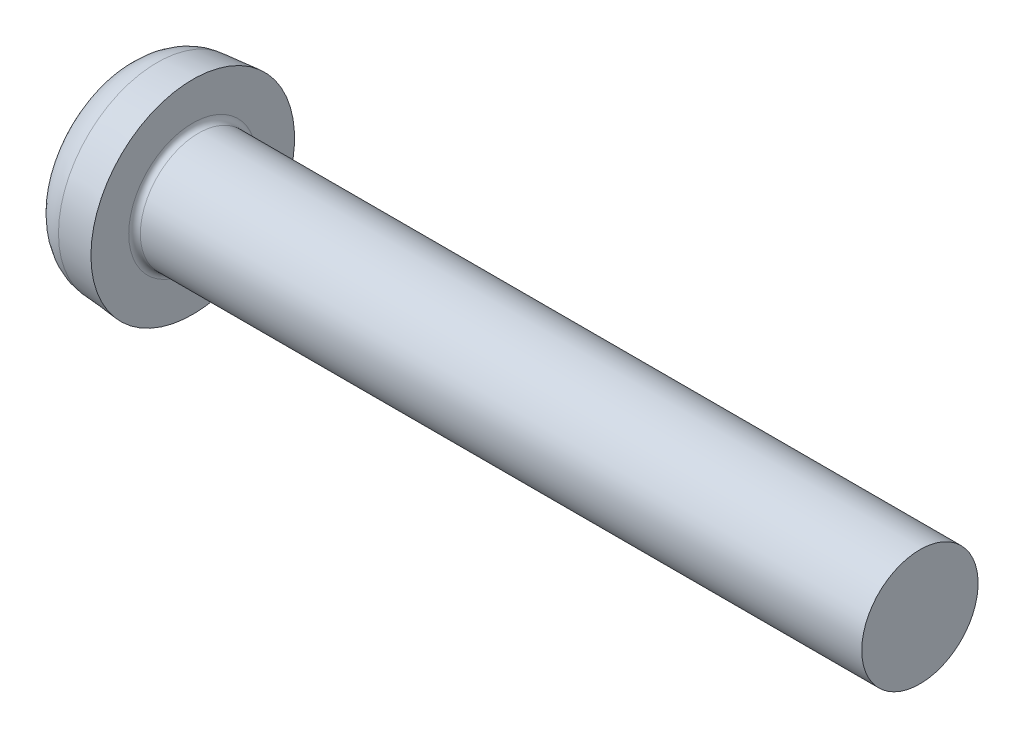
from build123d import *

# Parameters (mm, degrees)
FILLET1_R    = 0.4
RECPAT_COUNT = 2
RECPAT_ANGLE = 90


with BuildPart() as part:
    # BodySke → BaseBody (revolve)
    with BuildSketch(Plane.XY, mode=Mode.PRIVATE) as basebody_sk:
        with BuildLine():
            Line((5.4, 4), (5.4, 7))
            Line((5.4, 7), (2.956076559, 6.786184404))
            ThreePointArc((2.956076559, 6.786184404), (1.52557938, 6.199578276), (0.681056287, 4.904506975))
            ThreePointArc((0.681056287, 4.904506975), (0.171077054, 2.475784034), (0, 0))
            Line((0, 0), (55.4, 0))
            Line((55.4, 0), (55.4, 4))
            Line((55.4, 4), (5.4, 4))
        make_face()
    revolve(basebody_sk.sketch.rotate(Axis((0, 0, 0), (1, 0, 0)), 90), axis=Axis((0, 0, 0), (1, 0, 0)))

    # Fillet1
    fillet1_edges = [part.edges().sort_by_distance(p)[0] for p in [
        (5.4, 0, -4),
    ]]
    fillet(fillet1_edges, radius=FILLET1_R)

    # RecSkeTop → Recess section 0
    with BuildSketch(Plane(origin=(0, 0, 0), x_dir=(0, 0, -1), z_dir=(1, 0, 0))):
        with BuildLine():
            Line((-0.858, 3.9), (0.858, 3.9))
            Line((0.858, 3.9), (0.858, -3.9))
            Line((0.858, -3.9), (-0.858, -3.9))
            Line((-0.858, -3.9), (-0.858, 3.9))
        make_face()
    # RecSkeBot → Recess section 1
    with BuildSketch(Plane(origin=(4.36, 0, 0), x_dir=(0, 0, -1), z_dir=(1, 0, 0))):
        with BuildLine():
            Line((-0.858, 1.726184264), (0.858, 1.726184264))
            Line((0.858, 1.726184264), (0.858, -1.726184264))
            Line((0.858, -1.726184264), (-0.858, -1.726184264))
            Line((-0.858, -1.726184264), (-0.858, 1.726184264))
        make_face()
    recess = loft(mode=Mode.SUBTRACT)

    # RecPat: Recess ×2 about axis
    recpat_axis = Axis((0, 0, 0), (1, 0, 0))
    for i in range(1, RECPAT_COUNT):
        add(recess.rotate(recpat_axis, i * RECPAT_ANGLE / (RECPAT_COUNT - 1)), mode=Mode.SUBTRACT)

    # RecCorSke → RecessCore (revolve, cut)
    with BuildSketch(Plane.XY, mode=Mode.PRIVATE) as recesscore_sk:
        Polygon((0, 0), (0, 1.8876), (4.36, 1.5827191), (4.874256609, 0), align=None)
    revolve(recesscore_sk.sketch.rotate(Axis((0, 0, 0), (1, 0, 0)), 346.937939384), axis=Axis((0, 0, 0), (1, 0, 0)), mode=Mode.SUBTRACT)


solid = part.part
